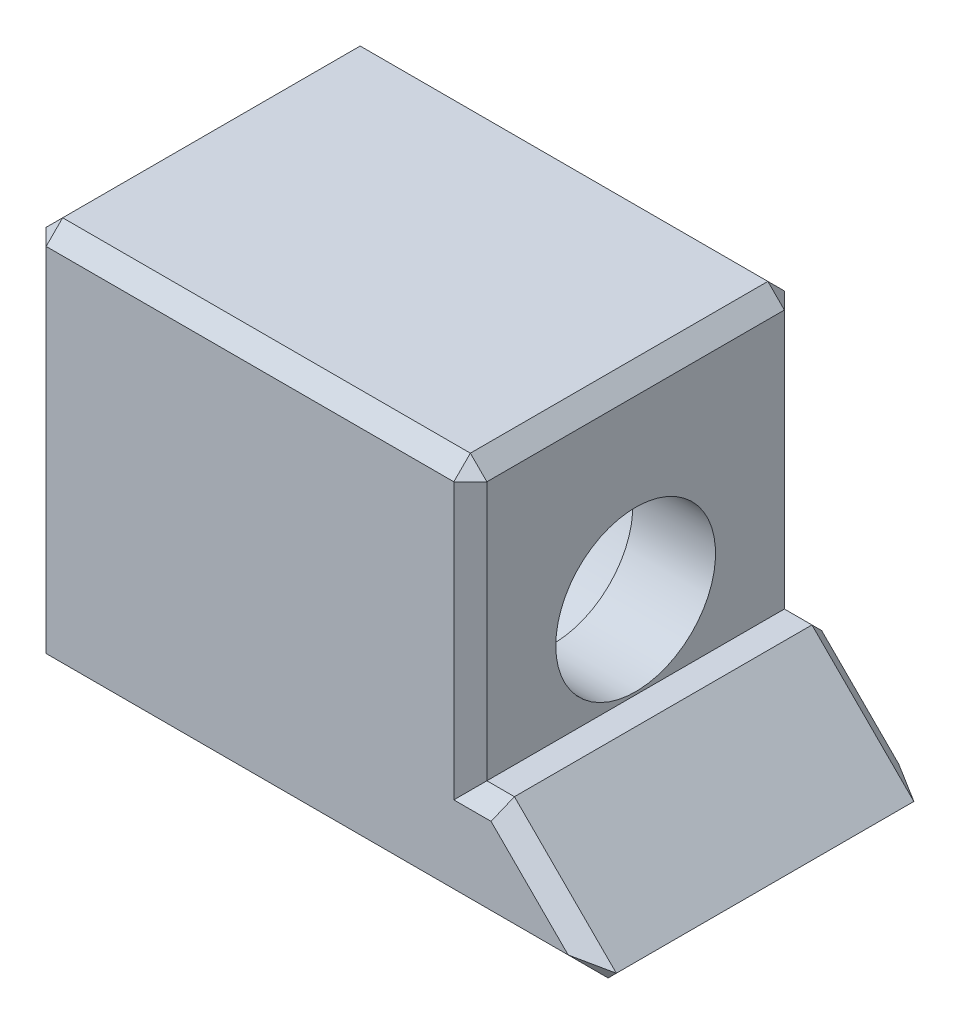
ISO-10303-21;
HEADER;
FILE_DESCRIPTION(('STEP AP214'),'2;1');
FILE_NAME('part.step','',(''),(''),'','','');
FILE_SCHEMA(('AUTOMOTIVE_DESIGN { 1 0 10303 214 1 1 1 1 }'));
ENDSEC;
DATA;
#1=APPLICATION_CONTEXT('core data for automotive mechanical design processes');
#2=APPLICATION_PROTOCOL_DEFINITION('international standard','automotive_design',2000,#1);
#3=PRODUCT_CONTEXT('',#1,'mechanical');
#4=PRODUCT('Part','Part','',(#3));
#5=PRODUCT_RELATED_PRODUCT_CATEGORY('part','',(#4));
#6=PRODUCT_DEFINITION_FORMATION('','',#4);
#7=PRODUCT_DEFINITION_CONTEXT('part definition',#1,'design');
#8=PRODUCT_DEFINITION('design','',#6,#7);
#9=PRODUCT_DEFINITION_SHAPE('','',#8);
#10=(LENGTH_UNIT() NAMED_UNIT(*) SI_UNIT(.MILLI.,.METRE.));
#11=(NAMED_UNIT(*) PLANE_ANGLE_UNIT() SI_UNIT($,.RADIAN.));
#12=(NAMED_UNIT(*) SI_UNIT($,.STERADIAN.) SOLID_ANGLE_UNIT());
#13=UNCERTAINTY_MEASURE_WITH_UNIT(LENGTH_MEASURE(1.E-05),#10,'distance_accuracy_value','');
#14=(GEOMETRIC_REPRESENTATION_CONTEXT(3) GLOBAL_UNCERTAINTY_ASSIGNED_CONTEXT((#13)) GLOBAL_UNIT_ASSIGNED_CONTEXT((#10,
#11,#12)) REPRESENTATION_CONTEXT('',''));
#15=CARTESIAN_POINT('',(0.,0.,0.));
#16=DIRECTION('',(0.,0.,1.));
#17=DIRECTION('',(1.,0.,0.));
#18=AXIS2_PLACEMENT_3D('',#15,#16,#17);
#19=CARTESIAN_POINT('',(5.24999999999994,5.25,6.));
#20=DIRECTION('',(-0.707106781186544,-0.707106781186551,0.));
#21=DIRECTION('',(0.707106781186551,-0.707106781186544,0.));
#22=AXIS2_PLACEMENT_3D('',#19,#20,#21);
#23=PLANE('',#22);
#24=DIRECTION('',(0.,0.,-1.));
#25=VECTOR('',#24,1.);
#26=CARTESIAN_POINT('',(10.35,0.15,6.));
#27=LINE('',#26,#25);
#28=CARTESIAN_POINT('',(10.35,0.15,5.7));
#29=VERTEX_POINT('',#28);
#30=CARTESIAN_POINT('',(10.35,0.15,0.300000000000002));
#31=VERTEX_POINT('',#30);
#32=EDGE_CURVE('E193',#29,#31,#27,.T.);
#33=ORIENTED_EDGE('',*,*,#32,.T.);
#34=DIRECTION('',(-0.707106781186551,0.707106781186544,0.));
#35=VECTOR('',#34,1.);
#36=CARTESIAN_POINT('',(5.24999999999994,5.25,0.300000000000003));
#37=LINE('',#36,#35);
#38=CARTESIAN_POINT('',(8.49999999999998,2.,0.300000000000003));
#39=VERTEX_POINT('',#38);
#40=EDGE_CURVE('E177',#31,#39,#37,.T.);
#41=ORIENTED_EDGE('',*,*,#40,.T.);
#42=DIRECTION('',(0.,0.,-1.));
#43=VECTOR('',#42,1.);
#44=CARTESIAN_POINT('',(8.49999999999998,2.,6.));
#45=LINE('',#44,#43);
#46=CARTESIAN_POINT('',(8.49999999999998,2.,5.7));
#47=VERTEX_POINT('',#46);
#48=EDGE_CURVE('E160',#47,#39,#45,.T.);
#49=ORIENTED_EDGE('',*,*,#48,.F.);
#50=DIRECTION('',(0.707106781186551,-0.707106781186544,0.));
#51=VECTOR('',#50,1.);
#52=CARTESIAN_POINT('',(10.5,0.,5.7));
#53=LINE('',#52,#51);
#54=EDGE_CURVE('E174',#47,#29,#53,.T.);
#55=ORIENTED_EDGE('',*,*,#54,.T.);
#56=EDGE_LOOP('',(#33,#41,#49,#55));
#57=FACE_BOUND('',#56,.T.);
#58=ADVANCED_FACE('F43',(#57),#23,.F.);
#59=CARTESIAN_POINT('',(0.,2.,6.));
#60=DIRECTION('',(0.,-1.,0.));
#61=DIRECTION('',(0.,0.,-1.));
#62=AXIS2_PLACEMENT_3D('',#59,#60,#61);
#63=PLANE('',#62);
#64=ORIENTED_EDGE('',*,*,#48,.T.);
#65=DIRECTION('',(-1.,0.,0.));
#66=VECTOR('',#65,1.);
#67=CARTESIAN_POINT('',(0.,2.,0.300000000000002));
#68=LINE('',#67,#66);
#69=CARTESIAN_POINT('',(8.,2.,0.300000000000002));
#70=VERTEX_POINT('',#69);
#71=EDGE_CURVE('E168',#39,#70,#68,.T.);
#72=ORIENTED_EDGE('',*,*,#71,.T.);
#73=DIRECTION('',(0.,0.,-1.));
#74=VECTOR('',#73,1.);
#75=CARTESIAN_POINT('',(8.,2.,6.));
#76=LINE('',#75,#74);
#77=CARTESIAN_POINT('',(8.,2.,5.7));
#78=VERTEX_POINT('',#77);
#79=EDGE_CURVE('E163',#78,#70,#76,.T.);
#80=ORIENTED_EDGE('',*,*,#79,.F.);
#81=DIRECTION('',(1.,0.,0.));
#82=VECTOR('',#81,1.);
#83=CARTESIAN_POINT('',(8.49999999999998,2.,5.7));
#84=LINE('',#83,#82);
#85=EDGE_CURVE('E157',#78,#47,#84,.T.);
#86=ORIENTED_EDGE('',*,*,#85,.T.);
#87=EDGE_LOOP('',(#64,#72,#80,#86));
#88=FACE_BOUND('',#87,.T.);
#89=ADVANCED_FACE('F159',(#88),#63,.F.);
#90=CARTESIAN_POINT('',(8.,0.,6.));
#91=DIRECTION('',(-1.,0.,0.));
#92=DIRECTION('',(0.,0.,1.));
#93=AXIS2_PLACEMENT_3D('',#90,#91,#92);
#94=PLANE('',#93);
#95=CARTESIAN_POINT('',(8.,3.5,3.));
#96=DIRECTION('',(-1.,0.,0.));
#97=DIRECTION('',(0.,0.,1.));
#98=AXIS2_PLACEMENT_3D('',#95,#96,#97);
#99=CIRCLE('',#98,1.45);
#100=CARTESIAN_POINT('',(8.,3.5,4.45));
#101=VERTEX_POINT('',#100);
#102=EDGE_CURVE('E197',#101,#101,#99,.T.);
#103=ORIENTED_EDGE('',*,*,#102,.T.);
#104=EDGE_LOOP('',(#103));
#105=FACE_BOUND('',#104,.T.);
#106=ORIENTED_EDGE('',*,*,#79,.T.);
#107=DIRECTION('',(0.,1.,0.));
#108=VECTOR('',#107,1.);
#109=CARTESIAN_POINT('',(8.,0.,0.300000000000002));
#110=LINE('',#109,#108);
#111=CARTESIAN_POINT('',(8.,6.7,0.300000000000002));
#112=VERTEX_POINT('',#111);
#113=EDGE_CURVE('E222',#70,#112,#110,.T.);
#114=ORIENTED_EDGE('',*,*,#113,.T.);
#115=DIRECTION('',(0.,0.,1.));
#116=VECTOR('',#115,1.);
#117=CARTESIAN_POINT('',(8.,6.7,6.));
#118=LINE('',#117,#116);
#119=CARTESIAN_POINT('',(8.,6.7,5.7));
#120=VERTEX_POINT('',#119);
#121=EDGE_CURVE('E220',#112,#120,#118,.T.);
#122=ORIENTED_EDGE('',*,*,#121,.T.);
#123=DIRECTION('',(0.,-1.,0.));
#124=VECTOR('',#123,1.);
#125=CARTESIAN_POINT('',(8.,2.,5.7));
#126=LINE('',#125,#124);
#127=EDGE_CURVE('E218',#120,#78,#126,.T.);
#128=ORIENTED_EDGE('',*,*,#127,.T.);
#129=EDGE_LOOP('',(#106,#114,#122,#128));
#130=FACE_BOUND('',#129,.T.);
#131=ADVANCED_FACE('F342',(#105,#130),#94,.F.);
#132=CARTESIAN_POINT('',(0.,7.,6.));
#133=DIRECTION('',(0.,1.,0.));
#134=DIRECTION('',(0.,0.,1.));
#135=AXIS2_PLACEMENT_3D('',#132,#133,#134);
#136=PLANE('',#135);
#137=DIRECTION('',(0.,0.,-1.));
#138=VECTOR('',#137,1.);
#139=CARTESIAN_POINT('',(7.7,7.,0.));
#140=LINE('',#139,#138);
#141=CARTESIAN_POINT('',(7.7,7.,5.7));
#142=VERTEX_POINT('',#141);
#143=CARTESIAN_POINT('',(7.7,7.,0.300000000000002));
#144=VERTEX_POINT('',#143);
#145=EDGE_CURVE('E213',#142,#144,#140,.T.);
#146=ORIENTED_EDGE('',*,*,#145,.T.);
#147=DIRECTION('',(-1.,0.,0.));
#148=VECTOR('',#147,1.);
#149=CARTESIAN_POINT('',(0.,7.,0.300000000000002));
#150=LINE('',#149,#148);
#151=CARTESIAN_POINT('',(0.300000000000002,7.,0.300000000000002));
#152=VERTEX_POINT('',#151);
#153=EDGE_CURVE('E216',#144,#152,#150,.T.);
#154=ORIENTED_EDGE('',*,*,#153,.T.);
#155=DIRECTION('',(0.,0.,1.));
#156=VECTOR('',#155,1.);
#157=CARTESIAN_POINT('',(0.300000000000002,7.,6.));
#158=LINE('',#157,#156);
#159=CARTESIAN_POINT('',(0.300000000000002,7.,5.7));
#160=VERTEX_POINT('',#159);
#161=EDGE_CURVE('E211',#152,#160,#158,.T.);
#162=ORIENTED_EDGE('',*,*,#161,.T.);
#163=DIRECTION('',(1.,0.,0.));
#164=VECTOR('',#163,1.);
#165=CARTESIAN_POINT('',(0.,7.,5.7));
#166=LINE('',#165,#164);
#167=EDGE_CURVE('E209',#160,#142,#166,.T.);
#168=ORIENTED_EDGE('',*,*,#167,.T.);
#169=EDGE_LOOP('',(#146,#154,#162,#168));
#170=FACE_BOUND('',#169,.T.);
#171=ADVANCED_FACE('F539',(#170),#136,.T.);
#172=CARTESIAN_POINT('',(0.,0.,6.));
#173=DIRECTION('',(-1.,0.,0.));
#174=DIRECTION('',(0.,0.,1.));
#175=AXIS2_PLACEMENT_3D('',#172,#173,#174);
#176=PLANE('',#175);
#177=DIRECTION('',(0.,1.,0.));
#178=VECTOR('',#177,1.);
#179=CARTESIAN_POINT('',(0.,0.,5.7));
#180=LINE('',#179,#178);
#181=CARTESIAN_POINT('',(0.,0.300000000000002,5.7));
#182=VERTEX_POINT('',#181);
#183=CARTESIAN_POINT('',(0.,6.7,5.7));
#184=VERTEX_POINT('',#183);
#185=EDGE_CURVE('E226',#182,#184,#180,.T.);
#186=ORIENTED_EDGE('',*,*,#185,.T.);
#187=DIRECTION('',(0.,0.,-1.));
#188=VECTOR('',#187,1.);
#189=CARTESIAN_POINT('',(0.,6.7,6.));
#190=LINE('',#189,#188);
#191=CARTESIAN_POINT('',(0.,6.7,0.300000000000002));
#192=VERTEX_POINT('',#191);
#193=EDGE_CURVE('E169',#184,#192,#190,.T.);
#194=ORIENTED_EDGE('',*,*,#193,.T.);
#195=DIRECTION('',(0.,-1.,0.));
#196=VECTOR('',#195,1.);
#197=CARTESIAN_POINT('',(0.,0.,0.300000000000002));
#198=LINE('',#197,#196);
#199=CARTESIAN_POINT('',(0.,0.300000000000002,0.300000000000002));
#200=VERTEX_POINT('',#199);
#201=EDGE_CURVE('E228',#192,#200,#198,.T.);
#202=ORIENTED_EDGE('',*,*,#201,.T.);
#203=DIRECTION('',(0.,0.,1.));
#204=VECTOR('',#203,1.);
#205=CARTESIAN_POINT('',(0.,0.300000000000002,6.));
#206=LINE('',#205,#204);
#207=EDGE_CURVE('E224',#200,#182,#206,.T.);
#208=ORIENTED_EDGE('',*,*,#207,.T.);
#209=EDGE_LOOP('',(#186,#194,#202,#208));
#210=FACE_BOUND('',#209,.T.);
#211=CARTESIAN_POINT('',(0.,3.5,3.));
#212=DIRECTION('',(-1.,0.,0.));
#213=DIRECTION('',(0.,0.,1.));
#214=AXIS2_PLACEMENT_3D('',#211,#212,#213);
#215=CIRCLE('',#214,2.5);
#216=CARTESIAN_POINT('',(0.,3.5,5.5));
#217=VERTEX_POINT('',#216);
#218=EDGE_CURVE('E324',#217,#217,#215,.T.);
#219=ORIENTED_EDGE('',*,*,#218,.F.);
#220=EDGE_LOOP('',(#219));
#221=FACE_BOUND('',#220,.T.);
#222=ADVANCED_FACE('F544',(#210,#221),#176,.T.);
#223=CARTESIAN_POINT('',(0.,0.,6.));
#224=DIRECTION('',(0.,1.,0.));
#225=DIRECTION('',(0.,0.,1.));
#226=AXIS2_PLACEMENT_3D('',#223,#224,#225);
#227=PLANE('',#226);
#228=DIRECTION('',(1.,0.,0.));
#229=VECTOR('',#228,1.);
#230=CARTESIAN_POINT('',(0.,0.,0.300000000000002));
#231=LINE('',#230,#229);
#232=CARTESIAN_POINT('',(0.300000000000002,0.,0.300000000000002));
#233=VERTEX_POINT('',#232);
#234=CARTESIAN_POINT('',(10.2,0.,0.300000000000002));
#235=VERTEX_POINT('',#234);
#236=EDGE_CURVE('E200',#233,#235,#231,.T.);
#237=ORIENTED_EDGE('',*,*,#236,.T.);
#238=DIRECTION('',(0.,0.,1.));
#239=VECTOR('',#238,1.);
#240=CARTESIAN_POINT('',(10.2,0.,6.));
#241=LINE('',#240,#239);
#242=CARTESIAN_POINT('',(10.2,0.,5.7));
#243=VERTEX_POINT('',#242);
#244=EDGE_CURVE('E206',#235,#243,#241,.T.);
#245=ORIENTED_EDGE('',*,*,#244,.T.);
#246=DIRECTION('',(-1.,0.,0.));
#247=VECTOR('',#246,1.);
#248=CARTESIAN_POINT('',(0.,0.,5.7));
#249=LINE('',#248,#247);
#250=CARTESIAN_POINT('',(0.300000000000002,0.,5.7));
#251=VERTEX_POINT('',#250);
#252=EDGE_CURVE('E204',#243,#251,#249,.T.);
#253=ORIENTED_EDGE('',*,*,#252,.T.);
#254=DIRECTION('',(0.,0.,-1.));
#255=VECTOR('',#254,1.);
#256=CARTESIAN_POINT('',(0.300000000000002,0.,0.));
#257=LINE('',#256,#255);
#258=EDGE_CURVE('E202',#251,#233,#257,.T.);
#259=ORIENTED_EDGE('',*,*,#258,.T.);
#260=EDGE_LOOP('',(#237,#245,#253,#259));
#261=FACE_BOUND('',#260,.T.);
#262=ADVANCED_FACE('F571',(#261),#227,.F.);
#263=CARTESIAN_POINT('',(0.,0.,6.));
#264=DIRECTION('',(0.,0.,1.));
#265=DIRECTION('',(1.,0.,0.));
#266=AXIS2_PLACEMENT_3D('',#263,#264,#265);
#267=PLANE('',#266);
#268=DIRECTION('',(-1.,0.,0.));
#269=VECTOR('',#268,1.);
#270=CARTESIAN_POINT('',(0.,6.7,6.));
#271=LINE('',#270,#269);
#272=CARTESIAN_POINT('',(7.7,6.7,6.));
#273=VERTEX_POINT('',#272);
#274=CARTESIAN_POINT('',(0.300000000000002,6.7,6.));
#275=VERTEX_POINT('',#274);
#276=EDGE_CURVE('E53',#273,#275,#271,.T.);
#277=ORIENTED_EDGE('',*,*,#276,.T.);
#278=DIRECTION('',(0.,-1.,0.));
#279=VECTOR('',#278,1.);
#280=CARTESIAN_POINT('',(0.300000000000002,0.,6.));
#281=LINE('',#280,#279);
#282=CARTESIAN_POINT('',(0.300000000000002,0.300000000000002,6.));
#283=VERTEX_POINT('',#282);
#284=EDGE_CURVE('E11',#275,#283,#281,.T.);
#285=ORIENTED_EDGE('',*,*,#284,.T.);
#286=DIRECTION('',(1.,0.,0.));
#287=VECTOR('',#286,1.);
#288=CARTESIAN_POINT('',(10.5,0.300000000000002,6.));
#289=LINE('',#288,#287);
#290=CARTESIAN_POINT('',(9.77573593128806,0.300000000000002,6.));
#291=VERTEX_POINT('',#290);
#292=EDGE_CURVE('E246',#283,#291,#289,.T.);
#293=ORIENTED_EDGE('',*,*,#292,.T.);
#294=DIRECTION('',(-0.707106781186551,0.707106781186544,0.));
#295=VECTOR('',#294,1.);
#296=CARTESIAN_POINT('',(8.28786796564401,1.78786796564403,6.));
#297=LINE('',#296,#295);
#298=CARTESIAN_POINT('',(8.37573593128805,1.7,6.));
#299=VERTEX_POINT('',#298);
#300=EDGE_CURVE('E248',#291,#299,#297,.T.);
#301=ORIENTED_EDGE('',*,*,#300,.T.);
#302=DIRECTION('',(-1.,0.,0.));
#303=VECTOR('',#302,1.);
#304=CARTESIAN_POINT('',(8.,1.7,6.));
#305=LINE('',#304,#303);
#306=CARTESIAN_POINT('',(7.7,1.7,6.));
#307=VERTEX_POINT('',#306);
#308=EDGE_CURVE('E183',#299,#307,#305,.T.);
#309=ORIENTED_EDGE('',*,*,#308,.T.);
#310=DIRECTION('',(0.,1.,0.));
#311=VECTOR('',#310,1.);
#312=CARTESIAN_POINT('',(7.7,7.,6.));
#313=LINE('',#312,#311);
#314=EDGE_CURVE('E64',#307,#273,#313,.T.);
#315=ORIENTED_EDGE('',*,*,#314,.T.);
#316=EDGE_LOOP('',(#277,#285,#293,#301,#309,#315));
#317=FACE_BOUND('',#316,.T.);
#318=ADVANCED_FACE('F358',(#317),#267,.T.);
#319=CARTESIAN_POINT('',(0.,0.,0.));
#320=DIRECTION('',(0.,0.,1.));
#321=DIRECTION('',(1.,0.,0.));
#322=AXIS2_PLACEMENT_3D('',#319,#320,#321);
#323=PLANE('',#322);
#324=DIRECTION('',(0.,-1.,0.));
#325=VECTOR('',#324,1.);
#326=CARTESIAN_POINT('',(7.7,0.,0.));
#327=LINE('',#326,#325);
#328=CARTESIAN_POINT('',(7.7,6.7,0.));
#329=VERTEX_POINT('',#328);
#330=CARTESIAN_POINT('',(7.7,1.7,0.));
#331=VERTEX_POINT('',#330);
#332=EDGE_CURVE('E241',#329,#331,#327,.T.);
#333=ORIENTED_EDGE('',*,*,#332,.T.);
#334=DIRECTION('',(1.,0.,0.));
#335=VECTOR('',#334,1.);
#336=CARTESIAN_POINT('',(0.,1.7,0.));
#337=LINE('',#336,#335);
#338=CARTESIAN_POINT('',(8.37573593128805,1.7,0.));
#339=VERTEX_POINT('',#338);
#340=EDGE_CURVE('E243',#331,#339,#337,.T.);
#341=ORIENTED_EDGE('',*,*,#340,.T.);
#342=DIRECTION('',(0.707106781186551,-0.707106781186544,0.));
#343=VECTOR('',#342,1.);
#344=CARTESIAN_POINT('',(5.03786796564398,5.03786796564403,0.));
#345=LINE('',#344,#343);
#346=CARTESIAN_POINT('',(9.77573593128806,0.300000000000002,0.));
#347=VERTEX_POINT('',#346);
#348=EDGE_CURVE('E235',#339,#347,#345,.T.);
#349=ORIENTED_EDGE('',*,*,#348,.T.);
#350=DIRECTION('',(-1.,0.,0.));
#351=VECTOR('',#350,1.);
#352=CARTESIAN_POINT('',(0.,0.300000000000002,0.));
#353=LINE('',#352,#351);
#354=CARTESIAN_POINT('',(0.300000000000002,0.300000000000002,0.));
#355=VERTEX_POINT('',#354);
#356=EDGE_CURVE('E233',#347,#355,#353,.T.);
#357=ORIENTED_EDGE('',*,*,#356,.T.);
#358=DIRECTION('',(0.,1.,0.));
#359=VECTOR('',#358,1.);
#360=CARTESIAN_POINT('',(0.300000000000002,7.,0.));
#361=LINE('',#360,#359);
#362=CARTESIAN_POINT('',(0.300000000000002,6.7,0.));
#363=VERTEX_POINT('',#362);
#364=EDGE_CURVE('E237',#355,#363,#361,.T.);
#365=ORIENTED_EDGE('',*,*,#364,.T.);
#366=DIRECTION('',(1.,0.,0.));
#367=VECTOR('',#366,1.);
#368=CARTESIAN_POINT('',(8.,6.7,0.));
#369=LINE('',#368,#367);
#370=EDGE_CURVE('E239',#363,#329,#369,.T.);
#371=ORIENTED_EDGE('',*,*,#370,.T.);
#372=EDGE_LOOP('',(#333,#341,#349,#357,#365,#371));
#373=FACE_BOUND('',#372,.T.);
#374=ADVANCED_FACE('F347',(#373),#323,.F.);
#375=CARTESIAN_POINT('',(0.,3.5,3.));
#376=DIRECTION('',(-1.,0.,0.));
#377=DIRECTION('',(0.,0.,1.));
#378=AXIS2_PLACEMENT_3D('',#375,#376,#377);
#379=CYLINDRICAL_SURFACE('',#378,1.45);
#380=CARTESIAN_POINT('',(6.5,3.5,3.));
#381=DIRECTION('',(-1.,0.,0.));
#382=DIRECTION('',(0.,0.,1.));
#383=AXIS2_PLACEMENT_3D('',#380,#381,#382);
#384=CIRCLE('',#383,1.45);
#385=CARTESIAN_POINT('',(6.5,3.5,4.45));
#386=VERTEX_POINT('',#385);
#387=EDGE_CURVE('E332',#386,#386,#384,.T.);
#388=ORIENTED_EDGE('',*,*,#387,.T.);
#389=EDGE_LOOP('',(#388));
#390=FACE_BOUND('',#389,.T.);
#391=ORIENTED_EDGE('',*,*,#102,.F.);
#392=EDGE_LOOP('',(#391));
#393=FACE_BOUND('',#392,.T.);
#394=ADVANCED_FACE('F344',(#390,#393),#379,.F.);
#395=CARTESIAN_POINT('',(6.5,4.95,3.));
#396=DIRECTION('',(1.,0.,0.));
#397=DIRECTION('',(0.,0.,-1.));
#398=AXIS2_PLACEMENT_3D('',#395,#396,#397);
#399=PLANE('',#398);
#400=ORIENTED_EDGE('',*,*,#387,.F.);
#401=EDGE_LOOP('',(#400));
#402=FACE_BOUND('',#401,.T.);
#403=CARTESIAN_POINT('',(6.5,3.5,3.));
#404=DIRECTION('',(-1.,0.,0.));
#405=DIRECTION('',(0.,0.,1.));
#406=AXIS2_PLACEMENT_3D('',#403,#404,#405);
#407=CIRCLE('',#406,2.5);
#408=CARTESIAN_POINT('',(6.5,3.5,5.5));
#409=VERTEX_POINT('',#408);
#410=EDGE_CURVE('E327',#409,#409,#407,.T.);
#411=ORIENTED_EDGE('',*,*,#410,.T.);
#412=EDGE_LOOP('',(#411));
#413=FACE_BOUND('',#412,.T.);
#414=ADVANCED_FACE('F346',(#402,#413),#399,.F.);
#415=CARTESIAN_POINT('',(0.,3.5,3.));
#416=DIRECTION('',(-1.,0.,0.));
#417=DIRECTION('',(0.,0.,1.));
#418=AXIS2_PLACEMENT_3D('',#415,#416,#417);
#419=CYLINDRICAL_SURFACE('',#418,2.5);
#420=ORIENTED_EDGE('',*,*,#410,.F.);
#421=EDGE_LOOP('',(#420));
#422=FACE_BOUND('',#421,.T.);
#423=ORIENTED_EDGE('',*,*,#218,.T.);
#424=EDGE_LOOP('',(#423));
#425=FACE_BOUND('',#424,.T.);
#426=ADVANCED_FACE('F354',(#422,#425),#419,.F.);
#427=CARTESIAN_POINT('',(0.,7.,5.7));
#428=DIRECTION('',(0.,-0.707106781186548,-0.707106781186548));
#429=DIRECTION('',(1.,0.,0.));
#430=AXIS2_PLACEMENT_3D('',#427,#428,#429);
#431=PLANE('',#430);
#432=DIRECTION('',(0.,0.707106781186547,-0.707106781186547));
#433=VECTOR('',#432,1.);
#434=CARTESIAN_POINT('',(7.7,6.85,5.85));
#435=LINE('',#434,#433);
#436=EDGE_CURVE('E317',#142,#273,#435,.F.);
#437=ORIENTED_EDGE('',*,*,#436,.F.);
#438=ORIENTED_EDGE('',*,*,#167,.F.);
#439=DIRECTION('',(0.,-0.707106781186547,0.707106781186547));
#440=VECTOR('',#439,1.);
#441=CARTESIAN_POINT('',(0.300000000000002,7.,5.7));
#442=LINE('',#441,#440);
#443=EDGE_CURVE('E319',#275,#160,#442,.F.);
#444=ORIENTED_EDGE('',*,*,#443,.F.);
#445=ORIENTED_EDGE('',*,*,#276,.F.);
#446=EDGE_LOOP('',(#437,#438,#444,#445));
#447=FACE_BOUND('',#446,.T.);
#448=ADVANCED_FACE('F46',(#447),#431,.F.);
#449=CARTESIAN_POINT('',(7.7,7.,6.));
#450=DIRECTION('',(0.707106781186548,0.707106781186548,0.));
#451=DIRECTION('',(0.,0.,1.));
#452=AXIS2_PLACEMENT_3D('',#449,#450,#451);
#453=PLANE('',#452);
#454=DIRECTION('',(0.707106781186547,-0.707106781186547,0.));
#455=VECTOR('',#454,1.);
#456=CARTESIAN_POINT('',(7.7,7.,0.300000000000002));
#457=LINE('',#456,#455);
#458=EDGE_CURVE('E311',#144,#112,#457,.T.);
#459=ORIENTED_EDGE('',*,*,#458,.F.);
#460=ORIENTED_EDGE('',*,*,#145,.F.);
#461=DIRECTION('',(-0.707106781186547,0.707106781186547,0.));
#462=VECTOR('',#461,1.);
#463=CARTESIAN_POINT('',(8.,6.7,5.7));
#464=LINE('',#463,#462);
#465=EDGE_CURVE('E314',#120,#142,#464,.T.);
#466=ORIENTED_EDGE('',*,*,#465,.F.);
#467=ORIENTED_EDGE('',*,*,#121,.F.);
#468=EDGE_LOOP('',(#459,#460,#466,#467));
#469=FACE_BOUND('',#468,.T.);
#470=ADVANCED_FACE('F517',(#469),#453,.T.);
#471=CARTESIAN_POINT('',(0.,6.7,0.));
#472=DIRECTION('',(0.,0.707106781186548,-0.707106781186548));
#473=DIRECTION('',(-1.,0.,0.));
#474=AXIS2_PLACEMENT_3D('',#471,#472,#473);
#475=PLANE('',#474);
#476=DIRECTION('',(0.,-0.707106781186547,-0.707106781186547));
#477=VECTOR('',#476,1.);
#478=CARTESIAN_POINT('',(0.300000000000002,6.85,0.150000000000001));
#479=LINE('',#478,#477);
#480=EDGE_CURVE('E306',#152,#363,#479,.T.);
#481=ORIENTED_EDGE('',*,*,#480,.F.);
#482=ORIENTED_EDGE('',*,*,#153,.F.);
#483=DIRECTION('',(0.,0.707106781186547,0.707106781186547));
#484=VECTOR('',#483,1.);
#485=CARTESIAN_POINT('',(7.7,7.,0.300000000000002));
#486=LINE('',#485,#484);
#487=EDGE_CURVE('E309',#329,#144,#486,.T.);
#488=ORIENTED_EDGE('',*,*,#487,.F.);
#489=ORIENTED_EDGE('',*,*,#370,.F.);
#490=EDGE_LOOP('',(#481,#482,#488,#489));
#491=FACE_BOUND('',#490,.T.);
#492=ADVANCED_FACE('F511',(#491),#475,.T.);
#493=CARTESIAN_POINT('',(0.,6.7,6.));
#494=DIRECTION('',(0.707106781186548,-0.707106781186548,0.));
#495=DIRECTION('',(0.,0.,-1.));
#496=AXIS2_PLACEMENT_3D('',#493,#494,#495);
#497=PLANE('',#496);
#498=DIRECTION('',(0.707106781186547,0.707106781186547,0.));
#499=VECTOR('',#498,1.);
#500=CARTESIAN_POINT('',(0.300000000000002,7.,5.7));
#501=LINE('',#500,#499);
#502=EDGE_CURVE('E48',#160,#184,#501,.F.);
#503=ORIENTED_EDGE('',*,*,#502,.F.);
#504=ORIENTED_EDGE('',*,*,#161,.F.);
#505=DIRECTION('',(-0.707106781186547,-0.707106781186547,0.));
#506=VECTOR('',#505,1.);
#507=CARTESIAN_POINT('',(0.,6.7,0.300000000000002));
#508=LINE('',#507,#506);
#509=EDGE_CURVE('E303',#192,#152,#508,.F.);
#510=ORIENTED_EDGE('',*,*,#509,.F.);
#511=ORIENTED_EDGE('',*,*,#193,.F.);
#512=EDGE_LOOP('',(#503,#504,#510,#511));
#513=FACE_BOUND('',#512,.T.);
#514=ADVANCED_FACE('F505',(#513),#497,.F.);
#515=CARTESIAN_POINT('',(0.300000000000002,7.,5.7));
#516=DIRECTION('',(-0.577350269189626,0.577350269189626,0.577350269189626));
#517=DIRECTION('',(0.707106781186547,0.,0.707106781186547));
#518=AXIS2_PLACEMENT_3D('',#515,#516,#517);
#519=PLANE('',#518);
#520=ORIENTED_EDGE('',*,*,#443,.T.);
#521=ORIENTED_EDGE('',*,*,#502,.T.);
#522=DIRECTION('',(-0.707106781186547,0.,-0.707106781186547));
#523=VECTOR('',#522,1.);
#524=CARTESIAN_POINT('',(0.150000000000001,6.7,5.85));
#525=LINE('',#524,#523);
#526=EDGE_CURVE('E300',#275,#184,#525,.T.);
#527=ORIENTED_EDGE('',*,*,#526,.F.);
#528=EDGE_LOOP('',(#520,#521,#527));
#529=FACE_BOUND('',#528,.T.);
#530=ADVANCED_FACE('F498',(#529),#519,.T.);
#531=CARTESIAN_POINT('',(8.,6.7,5.7));
#532=DIRECTION('',(0.577350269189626,0.577350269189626,0.577350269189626));
#533=DIRECTION('',(0.707106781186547,0.,-0.707106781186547));
#534=AXIS2_PLACEMENT_3D('',#531,#532,#533);
#535=PLANE('',#534);
#536=ORIENTED_EDGE('',*,*,#465,.T.);
#537=ORIENTED_EDGE('',*,*,#436,.T.);
#538=DIRECTION('',(0.707106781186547,0.,-0.707106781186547));
#539=VECTOR('',#538,1.);
#540=CARTESIAN_POINT('',(8.,6.7,5.7));
#541=LINE('',#540,#539);
#542=EDGE_CURVE('E297',#120,#273,#541,.F.);
#543=ORIENTED_EDGE('',*,*,#542,.F.);
#544=EDGE_LOOP('',(#536,#537,#543));
#545=FACE_BOUND('',#544,.T.);
#546=ADVANCED_FACE('F491',(#545),#535,.T.);
#547=CARTESIAN_POINT('',(7.7,7.,0.300000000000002));
#548=DIRECTION('',(0.577350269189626,0.577350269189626,-0.577350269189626));
#549=DIRECTION('',(-0.707106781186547,0.,-0.707106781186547));
#550=AXIS2_PLACEMENT_3D('',#547,#548,#549);
#551=PLANE('',#550);
#552=ORIENTED_EDGE('',*,*,#487,.T.);
#553=ORIENTED_EDGE('',*,*,#458,.T.);
#554=DIRECTION('',(0.707106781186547,0.,0.707106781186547));
#555=VECTOR('',#554,1.);
#556=CARTESIAN_POINT('',(7.85,6.7,0.150000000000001));
#557=LINE('',#556,#555);
#558=EDGE_CURVE('E294',#329,#112,#557,.T.);
#559=ORIENTED_EDGE('',*,*,#558,.F.);
#560=EDGE_LOOP('',(#552,#553,#559));
#561=FACE_BOUND('',#560,.T.);
#562=ADVANCED_FACE('F484',(#561),#551,.T.);
#563=CARTESIAN_POINT('',(0.,6.7,0.300000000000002));
#564=DIRECTION('',(-0.577350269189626,0.577350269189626,-0.577350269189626));
#565=DIRECTION('',(-0.707106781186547,0.,0.707106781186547));
#566=AXIS2_PLACEMENT_3D('',#563,#564,#565);
#567=PLANE('',#566);
#568=ORIENTED_EDGE('',*,*,#509,.T.);
#569=ORIENTED_EDGE('',*,*,#480,.T.);
#570=DIRECTION('',(-0.707106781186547,0.,0.707106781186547));
#571=VECTOR('',#570,1.);
#572=CARTESIAN_POINT('',(0.,6.7,0.300000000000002));
#573=LINE('',#572,#571);
#574=EDGE_CURVE('E291',#192,#363,#573,.F.);
#575=ORIENTED_EDGE('',*,*,#574,.F.);
#576=EDGE_LOOP('',(#568,#569,#575));
#577=FACE_BOUND('',#576,.T.);
#578=ADVANCED_FACE('F477',(#577),#567,.T.);
#579=CARTESIAN_POINT('',(0.,0.,5.7));
#580=DIRECTION('',(0.707106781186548,0.,-0.707106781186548));
#581=DIRECTION('',(0.,1.,0.));
#582=AXIS2_PLACEMENT_3D('',#579,#580,#581);
#583=PLANE('',#582);
#584=ORIENTED_EDGE('',*,*,#526,.T.);
#585=ORIENTED_EDGE('',*,*,#185,.F.);
#586=DIRECTION('',(0.707106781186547,0.,0.707106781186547));
#587=VECTOR('',#586,1.);
#588=CARTESIAN_POINT('',(0.300000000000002,0.300000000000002,6.));
#589=LINE('',#588,#587);
#590=EDGE_CURVE('E285',#283,#182,#589,.F.);
#591=ORIENTED_EDGE('',*,*,#590,.F.);
#592=ORIENTED_EDGE('',*,*,#284,.F.);
#593=EDGE_LOOP('',(#584,#585,#591,#592));
#594=FACE_BOUND('',#593,.T.);
#595=ADVANCED_FACE('F470',(#594),#583,.F.);
#596=CARTESIAN_POINT('',(7.7,0.,6.));
#597=DIRECTION('',(0.707106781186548,0.,0.707106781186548));
#598=DIRECTION('',(0.,-1.,0.));
#599=AXIS2_PLACEMENT_3D('',#596,#597,#598);
#600=PLANE('',#599);
#601=ORIENTED_EDGE('',*,*,#542,.T.);
#602=ORIENTED_EDGE('',*,*,#314,.F.);
#603=DIRECTION('',(-0.577350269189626,-0.577350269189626,0.577350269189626));
#604=VECTOR('',#603,1.);
#605=CARTESIAN_POINT('',(7.13333333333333,1.13333333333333,6.56666666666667));
#606=LINE('',#605,#604);
#607=EDGE_CURVE('E283',#78,#307,#606,.T.);
#608=ORIENTED_EDGE('',*,*,#607,.F.);
#609=ORIENTED_EDGE('',*,*,#127,.F.);
#610=EDGE_LOOP('',(#601,#602,#608,#609));
#611=FACE_BOUND('',#610,.T.);
#612=ADVANCED_FACE('F463',(#611),#600,.T.);
#613=CARTESIAN_POINT('',(8.,0.,0.300000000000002));
#614=DIRECTION('',(-0.707106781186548,0.,0.707106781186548));
#615=DIRECTION('',(0.,1.,0.));
#616=AXIS2_PLACEMENT_3D('',#613,#614,#615);
#617=PLANE('',#616);
#618=ORIENTED_EDGE('',*,*,#558,.T.);
#619=ORIENTED_EDGE('',*,*,#113,.F.);
#620=DIRECTION('',(-0.577350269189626,-0.577350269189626,-0.577350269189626));
#621=VECTOR('',#620,1.);
#622=CARTESIAN_POINT('',(5.33333333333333,-0.666666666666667,-2.36666666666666));
#623=LINE('',#622,#621);
#624=EDGE_CURVE('E280',#331,#70,#623,.F.);
#625=ORIENTED_EDGE('',*,*,#624,.F.);
#626=ORIENTED_EDGE('',*,*,#332,.F.);
#627=EDGE_LOOP('',(#618,#619,#625,#626));
#628=FACE_BOUND('',#627,.T.);
#629=ADVANCED_FACE('F456',(#628),#617,.F.);
#630=CARTESIAN_POINT('',(0.300000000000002,0.,0.));
#631=DIRECTION('',(-0.707106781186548,0.,-0.707106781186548));
#632=DIRECTION('',(0.,-1.,0.));
#633=AXIS2_PLACEMENT_3D('',#630,#631,#632);
#634=PLANE('',#633);
#635=ORIENTED_EDGE('',*,*,#574,.T.);
#636=ORIENTED_EDGE('',*,*,#364,.F.);
#637=DIRECTION('',(0.707106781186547,0.,-0.707106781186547));
#638=VECTOR('',#637,1.);
#639=CARTESIAN_POINT('',(0.,0.300000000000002,0.300000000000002));
#640=LINE('',#639,#638);
#641=EDGE_CURVE('E277',#200,#355,#640,.T.);
#642=ORIENTED_EDGE('',*,*,#641,.F.);
#643=ORIENTED_EDGE('',*,*,#201,.F.);
#644=EDGE_LOOP('',(#635,#636,#642,#643));
#645=FACE_BOUND('',#644,.T.);
#646=ADVANCED_FACE('F449',(#645),#634,.T.);
#647=CARTESIAN_POINT('',(0.300000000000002,0.,6.));
#648=DIRECTION('',(-0.707106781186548,-0.707106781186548,0.));
#649=DIRECTION('',(0.,0.,1.));
#650=AXIS2_PLACEMENT_3D('',#647,#648,#649);
#651=PLANE('',#650);
#652=DIRECTION('',(0.707106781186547,-0.707106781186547,0.));
#653=VECTOR('',#652,1.);
#654=CARTESIAN_POINT('',(0.150000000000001,0.150000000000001,5.7));
#655=LINE('',#654,#653);
#656=EDGE_CURVE('E288',#182,#251,#655,.T.);
#657=ORIENTED_EDGE('',*,*,#656,.F.);
#658=ORIENTED_EDGE('',*,*,#207,.F.);
#659=DIRECTION('',(-0.707106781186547,0.707106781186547,0.));
#660=VECTOR('',#659,1.);
#661=CARTESIAN_POINT('',(0.,0.300000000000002,0.300000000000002));
#662=LINE('',#661,#660);
#663=EDGE_CURVE('E274',#233,#200,#662,.T.);
#664=ORIENTED_EDGE('',*,*,#663,.F.);
#665=ORIENTED_EDGE('',*,*,#258,.F.);
#666=EDGE_LOOP('',(#657,#658,#664,#665));
#667=FACE_BOUND('',#666,.T.);
#668=ADVANCED_FACE('F442',(#667),#651,.T.);
#669=CARTESIAN_POINT('',(0.300000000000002,0.300000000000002,6.));
#670=DIRECTION('',(-0.577350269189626,-0.577350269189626,0.577350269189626));
#671=DIRECTION('',(0.707106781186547,0.,0.707106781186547));
#672=AXIS2_PLACEMENT_3D('',#669,#670,#671);
#673=PLANE('',#672);
#674=ORIENTED_EDGE('',*,*,#590,.T.);
#675=ORIENTED_EDGE('',*,*,#656,.T.);
#676=DIRECTION('',(0.,0.707106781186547,0.707106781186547));
#677=VECTOR('',#676,1.);
#678=CARTESIAN_POINT('',(0.300000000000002,0.300000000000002,6.));
#679=LINE('',#678,#677);
#680=EDGE_CURVE('E186',#283,#251,#679,.F.);
#681=ORIENTED_EDGE('',*,*,#680,.F.);
#682=EDGE_LOOP('',(#674,#675,#681));
#683=FACE_BOUND('',#682,.T.);
#684=ADVANCED_FACE('F436',(#683),#673,.T.);
#685=CARTESIAN_POINT('',(0.,1.7,6.));
#686=DIRECTION('',(0.,0.707106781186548,0.707106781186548));
#687=DIRECTION('',(1.,0.,0.));
#688=AXIS2_PLACEMENT_3D('',#685,#686,#687);
#689=PLANE('',#688);
#690=ORIENTED_EDGE('',*,*,#607,.T.);
#691=ORIENTED_EDGE('',*,*,#308,.F.);
#692=DIRECTION('',(-0.28108463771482,-0.678598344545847,0.678598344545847));
#693=VECTOR('',#692,1.);
#694=CARTESIAN_POINT('',(8.74869259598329,2.60039703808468,5.09960296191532));
#695=LINE('',#694,#693);
#696=EDGE_CURVE('E181',#47,#299,#695,.T.);
#697=ORIENTED_EDGE('',*,*,#696,.F.);
#698=ORIENTED_EDGE('',*,*,#85,.F.);
#699=EDGE_LOOP('',(#690,#691,#697,#698));
#700=FACE_BOUND('',#699,.T.);
#701=ADVANCED_FACE('F182',(#700),#689,.T.);
#702=CARTESIAN_POINT('',(0.,2.,0.300000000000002));
#703=DIRECTION('',(0.,-0.707106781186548,0.707106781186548));
#704=DIRECTION('',(-1.,0.,0.));
#705=AXIS2_PLACEMENT_3D('',#702,#703,#704);
#706=PLANE('',#705);
#707=ORIENTED_EDGE('',*,*,#624,.T.);
#708=ORIENTED_EDGE('',*,*,#71,.F.);
#709=DIRECTION('',(0.28108463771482,0.678598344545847,0.678598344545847));
#710=VECTOR('',#709,1.);
#711=CARTESIAN_POINT('',(8.86313873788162,2.8766944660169,1.1766944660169));
#712=LINE('',#711,#710);
#713=EDGE_CURVE('E187',#339,#39,#712,.T.);
#714=ORIENTED_EDGE('',*,*,#713,.F.);
#715=ORIENTED_EDGE('',*,*,#340,.F.);
#716=EDGE_LOOP('',(#707,#708,#714,#715));
#717=FACE_BOUND('',#716,.T.);
#718=ADVANCED_FACE('F423',(#717),#706,.F.);
#719=CARTESIAN_POINT('',(0.,0.300000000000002,0.300000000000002));
#720=DIRECTION('',(-0.577350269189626,-0.577350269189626,-0.577350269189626));
#721=DIRECTION('',(-0.707106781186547,0.,0.707106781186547));
#722=AXIS2_PLACEMENT_3D('',#719,#720,#721);
#723=PLANE('',#722);
#724=ORIENTED_EDGE('',*,*,#663,.T.);
#725=ORIENTED_EDGE('',*,*,#641,.T.);
#726=DIRECTION('',(0.,0.707106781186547,-0.707106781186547));
#727=VECTOR('',#726,1.);
#728=CARTESIAN_POINT('',(0.300000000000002,0.150000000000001,0.150000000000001));
#729=LINE('',#728,#727);
#730=EDGE_CURVE('E267',#233,#355,#729,.T.);
#731=ORIENTED_EDGE('',*,*,#730,.F.);
#732=EDGE_LOOP('',(#724,#725,#731));
#733=FACE_BOUND('',#732,.T.);
#734=ADVANCED_FACE('F416',(#733),#723,.T.);
#735=CARTESIAN_POINT('',(0.,0.300000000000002,6.));
#736=DIRECTION('',(0.,-0.707106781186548,0.707106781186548));
#737=DIRECTION('',(-1.,0.,0.));
#738=AXIS2_PLACEMENT_3D('',#735,#736,#737);
#739=PLANE('',#738);
#740=ORIENTED_EDGE('',*,*,#680,.T.);
#741=ORIENTED_EDGE('',*,*,#252,.F.);
#742=DIRECTION('',(0.707106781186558,-0.499999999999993,-0.499999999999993));
#743=VECTOR('',#742,1.);
#744=CARTESIAN_POINT('',(10.2,0.,5.7));
#745=LINE('',#744,#743);
#746=EDGE_CURVE('E264',#291,#243,#745,.T.);
#747=ORIENTED_EDGE('',*,*,#746,.F.);
#748=ORIENTED_EDGE('',*,*,#292,.F.);
#749=EDGE_LOOP('',(#740,#741,#747,#748));
#750=FACE_BOUND('',#749,.T.);
#751=ADVANCED_FACE('F410',(#750),#739,.T.);
#752=CARTESIAN_POINT('',(5.03786796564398,5.03786796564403,6.));
#753=DIRECTION('',(0.499999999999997,0.500000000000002,0.707106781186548));
#754=DIRECTION('',(0.707106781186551,-0.707106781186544,0.));
#755=AXIS2_PLACEMENT_3D('',#752,#753,#754);
#756=PLANE('',#755);
#757=ORIENTED_EDGE('',*,*,#696,.T.);
#758=ORIENTED_EDGE('',*,*,#300,.F.);
#759=DIRECTION('',(-0.863502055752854,0.2255500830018,0.451100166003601));
#760=VECTOR('',#759,1.);
#761=CARTESIAN_POINT('',(10.2673690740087,0.171583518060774,5.74316703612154));
#762=LINE('',#761,#760);
#763=EDGE_CURVE('E191',#29,#291,#762,.T.);
#764=ORIENTED_EDGE('',*,*,#763,.F.);
#765=ORIENTED_EDGE('',*,*,#54,.F.);
#766=EDGE_LOOP('',(#757,#758,#764,#765));
#767=FACE_BOUND('',#766,.T.);
#768=ADVANCED_FACE('F189',(#767),#756,.T.);
#769=CARTESIAN_POINT('',(5.24999999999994,5.25,0.300000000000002));
#770=DIRECTION('',(-0.499999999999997,-0.500000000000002,0.707106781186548));
#771=DIRECTION('',(-0.707106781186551,0.707106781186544,0.));
#772=AXIS2_PLACEMENT_3D('',#769,#770,#771);
#773=PLANE('',#772);
#774=ORIENTED_EDGE('',*,*,#713,.T.);
#775=ORIENTED_EDGE('',*,*,#40,.F.);
#776=DIRECTION('',(-0.863502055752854,0.2255500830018,-0.451100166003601));
#777=VECTOR('',#776,1.);
#778=CARTESIAN_POINT('',(10.35,0.150000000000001,0.300000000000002));
#779=LINE('',#778,#777);
#780=EDGE_CURVE('E260',#347,#31,#779,.F.);
#781=ORIENTED_EDGE('',*,*,#780,.F.);
#782=ORIENTED_EDGE('',*,*,#348,.F.);
#783=EDGE_LOOP('',(#774,#775,#781,#782));
#784=FACE_BOUND('',#783,.T.);
#785=ADVANCED_FACE('F397',(#784),#773,.F.);
#786=CARTESIAN_POINT('',(0.,0.,0.300000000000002));
#787=DIRECTION('',(0.,0.707106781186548,0.707106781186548));
#788=DIRECTION('',(1.,0.,0.));
#789=AXIS2_PLACEMENT_3D('',#786,#787,#788);
#790=PLANE('',#789);
#791=ORIENTED_EDGE('',*,*,#730,.T.);
#792=ORIENTED_EDGE('',*,*,#356,.F.);
#793=DIRECTION('',(0.707106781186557,-0.499999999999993,0.499999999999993));
#794=VECTOR('',#793,1.);
#795=CARTESIAN_POINT('',(10.221966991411,-0.01553300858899,0.315533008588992));
#796=LINE('',#795,#794);
#797=EDGE_CURVE('E257',#235,#347,#796,.F.);
#798=ORIENTED_EDGE('',*,*,#797,.F.);
#799=ORIENTED_EDGE('',*,*,#236,.F.);
#800=EDGE_LOOP('',(#791,#792,#798,#799));
#801=FACE_BOUND('',#800,.T.);
#802=ADVANCED_FACE('F390',(#801),#790,.F.);
#803=CARTESIAN_POINT('',(10.2,0.,5.7));
#804=DIRECTION('',(0.357406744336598,-0.357406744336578,0.862856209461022));
#805=DIRECTION('',(0.923879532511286,0.,-0.382683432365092));
#806=AXIS2_PLACEMENT_3D('',#803,#804,#805);
#807=PLANE('',#806);
#808=ORIENTED_EDGE('',*,*,#763,.T.);
#809=ORIENTED_EDGE('',*,*,#746,.T.);
#810=DIRECTION('',(-0.707106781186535,-0.70710678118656,0.));
#811=VECTOR('',#810,1.);
#812=CARTESIAN_POINT('',(10.2,0.,5.7));
#813=LINE('',#812,#811);
#814=EDGE_CURVE('E255',#29,#243,#813,.T.);
#815=ORIENTED_EDGE('',*,*,#814,.F.);
#816=EDGE_LOOP('',(#808,#809,#815));
#817=FACE_BOUND('',#816,.T.);
#818=ADVANCED_FACE('F384',(#817),#807,.T.);
#819=CARTESIAN_POINT('',(10.35,0.15,0.300000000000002));
#820=DIRECTION('',(0.357406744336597,-0.357406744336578,-0.862856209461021));
#821=DIRECTION('',(-0.923879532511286,0.,-0.382683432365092));
#822=AXIS2_PLACEMENT_3D('',#819,#820,#821);
#823=PLANE('',#822);
#824=ORIENTED_EDGE('',*,*,#797,.T.);
#825=ORIENTED_EDGE('',*,*,#780,.T.);
#826=DIRECTION('',(0.707106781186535,0.70710678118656,0.));
#827=VECTOR('',#826,1.);
#828=CARTESIAN_POINT('',(10.35,0.15,0.300000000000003));
#829=LINE('',#828,#827);
#830=EDGE_CURVE('E253',#235,#31,#829,.T.);
#831=ORIENTED_EDGE('',*,*,#830,.F.);
#832=EDGE_LOOP('',(#824,#825,#831));
#833=FACE_BOUND('',#832,.T.);
#834=ADVANCED_FACE('F378',(#833),#823,.T.);
#835=CARTESIAN_POINT('',(10.35,0.149999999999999,6.));
#836=DIRECTION('',(-0.70710678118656,0.707106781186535,0.));
#837=DIRECTION('',(0.,0.,-1.));
#838=AXIS2_PLACEMENT_3D('',#835,#836,#837);
#839=PLANE('',#838);
#840=ORIENTED_EDGE('',*,*,#814,.T.);
#841=ORIENTED_EDGE('',*,*,#244,.F.);
#842=ORIENTED_EDGE('',*,*,#830,.T.);
#843=ORIENTED_EDGE('',*,*,#32,.F.);
#844=EDGE_LOOP('',(#840,#841,#842,#843));
#845=FACE_BOUND('',#844,.T.);
#846=ADVANCED_FACE('F372',(#845),#839,.F.);
#847=CLOSED_SHELL('',(#58,#89,#131,#171,#222,#262,#318,#374,#394,#414,#426,#448,#470,#492,#514,
#530,#546,#562,#578,#595,#612,#629,#646,#668,#684,#701,#718,#734,#751,#768,#785,#802,#818,#834,#846));
#848=MANIFOLD_SOLID_BREP('B2',#847);
#849=ADVANCED_BREP_SHAPE_REPRESENTATION('',(#18,#848),#14);
#850=SHAPE_DEFINITION_REPRESENTATION(#9,#849);
ENDSEC;
END-ISO-10303-21;
